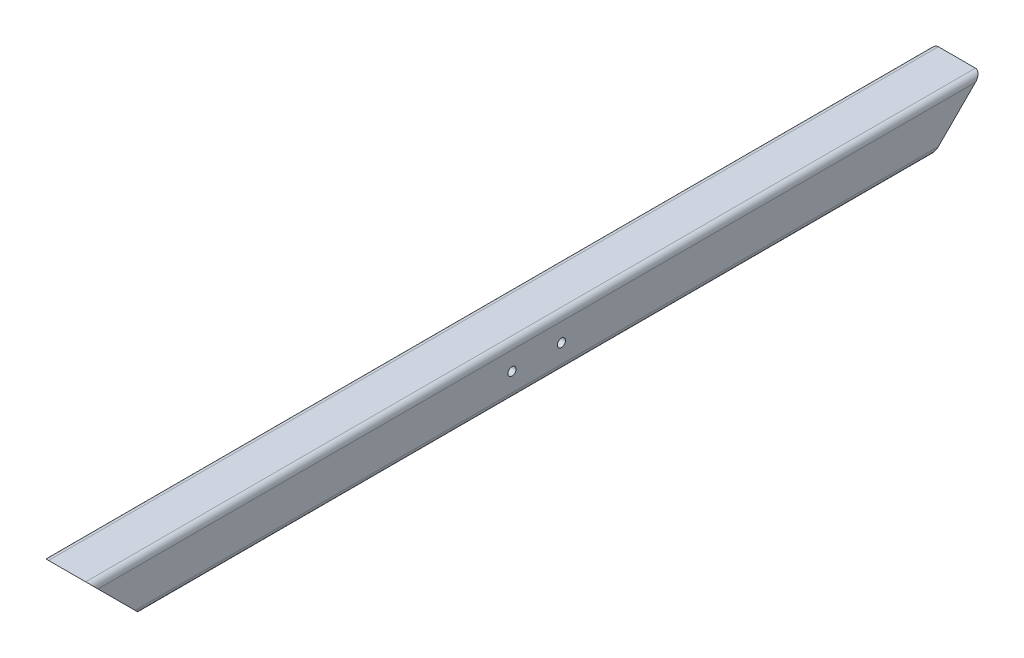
from build123d import *

# Parameters (mm, degrees)
SKETCH1_W                = 38.1
SKETCH1_H                = 38.1
BOSS_EXTRUDE1_DEPTH      = 914.4
CUT_EXTRUDE1_DEPTH       = 917.162190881
CUT_EXTRUDE1_DEPTH_BACK  = 917.162190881
CUT_EXTRUDE2_DEPTH       = 917.162190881
CUT_EXTRUDE2_DEPTH_BACK  = 917.162190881
F_5_16_CLEARANCE_HOLE1_D = 8.4328


with BuildPart() as part:
    # Sketch1 → Boss-Extrude1 (new body)
    with BuildSketch(Plane.XY):
        with BuildLine():
            Line((-19.05, -25.4), (19.05, -25.4))
            ThreePointArc((19.05, -25.4), (23.540128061, -23.540128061), (25.4, -19.05))
            Line((25.4, -19.05), (25.4, 19.05))
            ThreePointArc((25.4, 19.05), (23.540128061, 23.540128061), (19.05, 25.4))
            Line((19.05, 25.4), (-19.05, 25.4))
            ThreePointArc((-19.05, 25.4), (-23.540128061, 23.540128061), (-25.4, 19.05))
            Line((-25.4, 19.05), (-25.4, -19.05))
            ThreePointArc((-25.4, -19.05), (-23.540128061, -23.540128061), (-19.05, -25.4))
        make_face()
        Rectangle(SKETCH1_W, SKETCH1_H, mode=Mode.SUBTRACT)
    extrude(amount=-BOSS_EXTRUDE1_DEPTH)

    # Sketch2 → Cut-Extrude1 (cut, two sides: drawn at the far end of the back side and taken through both)
    with BuildSketch(Plane(origin=(25.4, 0, 0), x_dir=(0, 0, -1), z_dir=(1, 0, 0)).offset(-CUT_EXTRUDE1_DEPTH_BACK)):
        Polygon((-1302.222024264, 1327.622024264), (0, 25.4), (50.8, -25.4), (1353.022024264, -1327.622024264), (-1251.422024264, -3932.066072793), (-3906.666072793, -1276.822024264), align=None)
    extrude(amount=CUT_EXTRUDE1_DEPTH + CUT_EXTRUDE1_DEPTH_BACK, mode=Mode.SUBTRACT)

    # Sketch3 → Cut-Extrude2 (cut, two sides: drawn at the far end of the back side and taken through both)
    with BuildSketch(Plane(origin=(25.4, 0, 0), x_dir=(0, 0, -1), z_dir=(1, 0, 0)).offset(-CUT_EXTRUDE2_DEPTH_BACK)):
        Polygon((2216.622024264, 1327.622024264), (914.4, 25.4), (863.6, -25.4), (-438.622024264, -1327.622024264), (2165.822024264, -3932.066072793), (4821.066072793, -1276.822024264), align=None)
    extrude(amount=CUT_EXTRUDE2_DEPTH + CUT_EXTRUDE2_DEPTH_BACK, mode=Mode.SUBTRACT)

    # 5_16 Clearance Hole1 (through all)
    with Locations(Plane(origin=(25.4, 0, 0), x_dir=(0, 0, -1), z_dir=(1, 0, 0))):
        with Locations((482.6, 0), (431.8, 0)):
            Hole(F_5_16_CLEARANCE_HOLE1_D / 2)


solid = part.part
